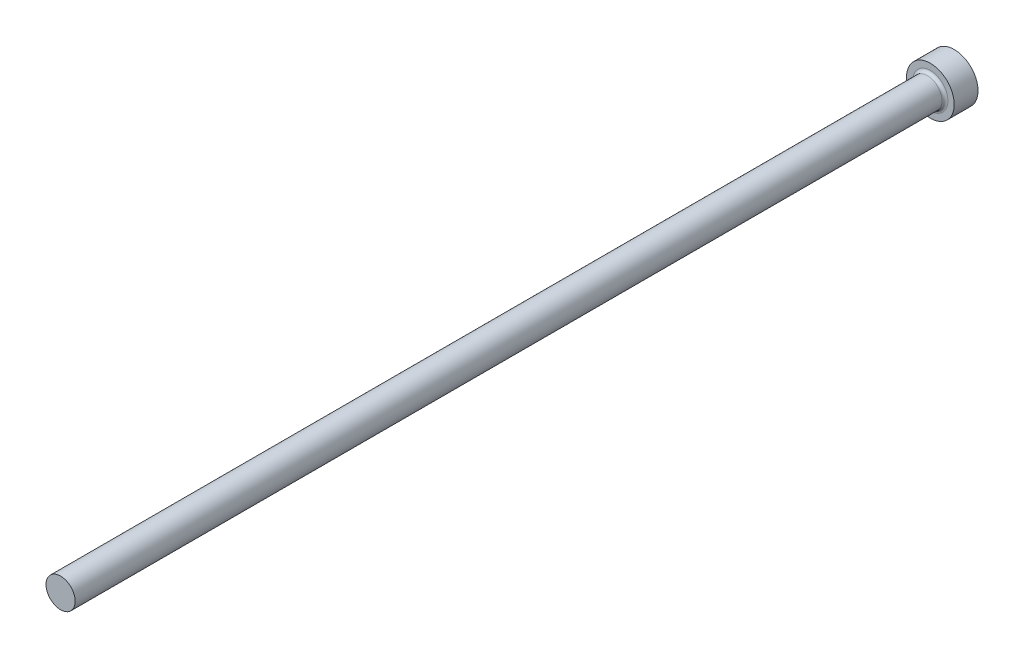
ISO-10303-21;
HEADER;
FILE_DESCRIPTION(('STEP AP214'),'2;1');
FILE_NAME('part.step','',(''),(''),'','','');
FILE_SCHEMA(('AUTOMOTIVE_DESIGN { 1 0 10303 214 1 1 1 1 }'));
ENDSEC;
DATA;
#1=APPLICATION_CONTEXT('core data for automotive mechanical design processes');
#2=APPLICATION_PROTOCOL_DEFINITION('international standard','automotive_design',2000,#1);
#3=PRODUCT_CONTEXT('',#1,'mechanical');
#4=PRODUCT('Part','Part','',(#3));
#5=PRODUCT_RELATED_PRODUCT_CATEGORY('part','',(#4));
#6=PRODUCT_DEFINITION_FORMATION('','',#4);
#7=PRODUCT_DEFINITION_CONTEXT('part definition',#1,'design');
#8=PRODUCT_DEFINITION('design','',#6,#7);
#9=PRODUCT_DEFINITION_SHAPE('','',#8);
#10=(LENGTH_UNIT() NAMED_UNIT(*) SI_UNIT(.MILLI.,.METRE.));
#11=(NAMED_UNIT(*) PLANE_ANGLE_UNIT() SI_UNIT($,.RADIAN.));
#12=(NAMED_UNIT(*) SI_UNIT($,.STERADIAN.) SOLID_ANGLE_UNIT());
#13=UNCERTAINTY_MEASURE_WITH_UNIT(LENGTH_MEASURE(1.E-05),#10,'distance_accuracy_value','');
#14=(GEOMETRIC_REPRESENTATION_CONTEXT(3) GLOBAL_UNCERTAINTY_ASSIGNED_CONTEXT((#13)) GLOBAL_UNIT_ASSIGNED_CONTEXT((#10,
#11,#12)) REPRESENTATION_CONTEXT('',''));
#15=CARTESIAN_POINT('',(0.,0.,0.));
#16=DIRECTION('',(0.,0.,1.));
#17=DIRECTION('',(1.,0.,0.));
#18=AXIS2_PLACEMENT_3D('',#15,#16,#17);
#19=CARTESIAN_POINT('',(4.,0.,4.));
#20=DIRECTION('',(0.,0.,-1.));
#21=DIRECTION('',(-1.,0.,0.));
#22=AXIS2_PLACEMENT_3D('',#19,#20,#21);
#23=PLANE('',#22);
#24=CARTESIAN_POINT('',(0.,0.,4.));
#25=DIRECTION('',(0.,0.,-1.));
#26=DIRECTION('',(-1.,0.,0.));
#27=AXIS2_PLACEMENT_3D('',#24,#25,#26);
#28=CIRCLE('',#27,2.95000000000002);
#29=CARTESIAN_POINT('',(-2.95000000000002,0.,4.));
#30=VERTEX_POINT('',#29);
#31=EDGE_CURVE('E40',#30,#30,#28,.T.);
#32=ORIENTED_EDGE('',*,*,#31,.T.);
#33=EDGE_LOOP('',(#32));
#34=FACE_BOUND('',#33,.T.);
#35=CARTESIAN_POINT('',(0.,0.,4.));
#36=DIRECTION('',(0.,0.,-1.));
#37=DIRECTION('',(-1.,0.,0.));
#38=AXIS2_PLACEMENT_3D('',#35,#36,#37);
#39=CIRCLE('',#38,4.);
#40=CARTESIAN_POINT('',(-4.,0.,4.));
#41=VERTEX_POINT('',#40);
#42=EDGE_CURVE('E44',#41,#41,#39,.T.);
#43=ORIENTED_EDGE('',*,*,#42,.F.);
#44=EDGE_LOOP('',(#43));
#45=FACE_BOUND('',#44,.T.);
#46=ADVANCED_FACE('F33',(#34,#45),#23,.F.);
#47=CARTESIAN_POINT('',(0.,0.,-9.03322817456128));
#48=DIRECTION('',(0.,0.,-1.));
#49=DIRECTION('',(-1.,0.,0.));
#50=AXIS2_PLACEMENT_3D('',#47,#48,#49);
#51=CYLINDRICAL_SURFACE('',#50,4.);
#52=CARTESIAN_POINT('',(0.,0.,0.));
#53=DIRECTION('',(0.,0.,-1.));
#54=DIRECTION('',(-1.,0.,0.));
#55=AXIS2_PLACEMENT_3D('',#52,#53,#54);
#56=CIRCLE('',#55,4.);
#57=CARTESIAN_POINT('',(-4.,0.,0.));
#58=VERTEX_POINT('',#57);
#59=EDGE_CURVE('E48',#58,#58,#56,.T.);
#60=ORIENTED_EDGE('',*,*,#59,.F.);
#61=EDGE_LOOP('',(#60));
#62=FACE_BOUND('',#61,.T.);
#63=ORIENTED_EDGE('',*,*,#42,.T.);
#64=EDGE_LOOP('',(#63));
#65=FACE_BOUND('',#64,.T.);
#66=ADVANCED_FACE('F68',(#62,#65),#51,.T.);
#67=CARTESIAN_POINT('',(0.,0.,0.));
#68=DIRECTION('',(0.,0.,1.));
#69=DIRECTION('',(1.,0.,0.));
#70=AXIS2_PLACEMENT_3D('',#67,#68,#69);
#71=PLANE('',#70);
#72=ORIENTED_EDGE('',*,*,#59,.T.);
#73=EDGE_LOOP('',(#72));
#74=FACE_BOUND('',#73,.T.);
#75=ADVANCED_FACE('F61',(#74),#71,.F.);
#76=CARTESIAN_POINT('',(0.,0.,150.));
#77=DIRECTION('',(0.,0.,-1.));
#78=DIRECTION('',(-1.,0.,0.));
#79=AXIS2_PLACEMENT_3D('',#76,#77,#78);
#80=PLANE('',#79);
#81=CARTESIAN_POINT('',(0.,0.,150.));
#82=DIRECTION('',(0.,0.,-1.));
#83=DIRECTION('',(-1.,0.,0.));
#84=AXIS2_PLACEMENT_3D('',#81,#82,#83);
#85=CIRCLE('',#84,2.45000000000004);
#86=CARTESIAN_POINT('',(-2.45000000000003,0.,150.));
#87=VERTEX_POINT('',#86);
#88=EDGE_CURVE('E53',#87,#87,#85,.T.);
#89=ORIENTED_EDGE('',*,*,#88,.F.);
#90=EDGE_LOOP('',(#89));
#91=FACE_BOUND('',#90,.T.);
#92=ADVANCED_FACE('F59',(#91),#80,.F.);
#93=CARTESIAN_POINT('',(0.,0.,-9.03322817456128));
#94=DIRECTION('',(0.,0.,-1.));
#95=DIRECTION('',(-1.,0.,0.));
#96=AXIS2_PLACEMENT_3D('',#93,#94,#95);
#97=CYLINDRICAL_SURFACE('',#96,2.45000000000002);
#98=CARTESIAN_POINT('',(0.,0.,4.5));
#99=DIRECTION('',(0.,0.,-1.));
#100=DIRECTION('',(-1.,0.,0.));
#101=AXIS2_PLACEMENT_3D('',#98,#99,#100);
#102=CIRCLE('',#101,2.45000000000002);
#103=CARTESIAN_POINT('',(-2.45000000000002,0.,4.5));
#104=VERTEX_POINT('',#103);
#105=EDGE_CURVE('E10',#104,#104,#102,.F.);
#106=ORIENTED_EDGE('',*,*,#105,.T.);
#107=EDGE_LOOP('',(#106));
#108=FACE_BOUND('',#107,.T.);
#109=ORIENTED_EDGE('',*,*,#88,.T.);
#110=EDGE_LOOP('',(#109));
#111=FACE_BOUND('',#110,.T.);
#112=ADVANCED_FACE('F57',(#108,#111),#97,.T.);
#113=CARTESIAN_POINT('',(0.,0.,4.5));
#114=DIRECTION('',(0.,0.,-1.));
#115=DIRECTION('',(-1.,0.,0.));
#116=AXIS2_PLACEMENT_3D('',#113,#114,#115);
#117=TOROIDAL_SURFACE('',#116,2.95000000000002,0.5);
#118=ORIENTED_EDGE('',*,*,#105,.F.);
#119=EDGE_LOOP('',(#118));
#120=FACE_BOUND('',#119,.T.);
#121=ORIENTED_EDGE('',*,*,#31,.F.);
#122=EDGE_LOOP('',(#121));
#123=FACE_BOUND('',#122,.T.);
#124=ADVANCED_FACE('F35',(#120,#123),#117,.F.);
#125=CLOSED_SHELL('',(#46,#66,#75,#92,#112,#124));
#126=MANIFOLD_SOLID_BREP('B2',#125);
#127=ADVANCED_BREP_SHAPE_REPRESENTATION('',(#18,#126),#14);
#128=SHAPE_DEFINITION_REPRESENTATION(#9,#127);
ENDSEC;
END-ISO-10303-21;
